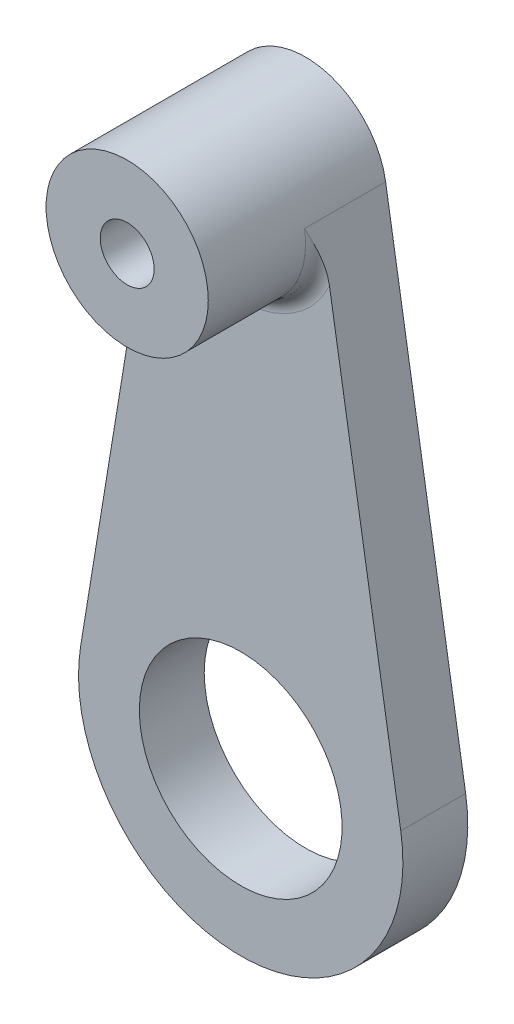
ISO-10303-21;
HEADER;
FILE_DESCRIPTION(('STEP AP214'),'2;1');
FILE_NAME('part.step','',(''),(''),'','','');
FILE_SCHEMA(('AUTOMOTIVE_DESIGN { 1 0 10303 214 1 1 1 1 }'));
ENDSEC;
DATA;
#1=APPLICATION_CONTEXT('core data for automotive mechanical design processes');
#2=APPLICATION_PROTOCOL_DEFINITION('international standard','automotive_design',2000,#1);
#3=PRODUCT_CONTEXT('',#1,'mechanical');
#4=PRODUCT('Part','Part','',(#3));
#5=PRODUCT_RELATED_PRODUCT_CATEGORY('part','',(#4));
#6=PRODUCT_DEFINITION_FORMATION('','',#4);
#7=PRODUCT_DEFINITION_CONTEXT('part definition',#1,'design');
#8=PRODUCT_DEFINITION('design','',#6,#7);
#9=PRODUCT_DEFINITION_SHAPE('','',#8);
#10=(LENGTH_UNIT() NAMED_UNIT(*) SI_UNIT(.MILLI.,.METRE.));
#11=(NAMED_UNIT(*) PLANE_ANGLE_UNIT() SI_UNIT($,.RADIAN.));
#12=(NAMED_UNIT(*) SI_UNIT($,.STERADIAN.) SOLID_ANGLE_UNIT());
#13=UNCERTAINTY_MEASURE_WITH_UNIT(LENGTH_MEASURE(1.E-05),#10,'distance_accuracy_value','');
#14=(GEOMETRIC_REPRESENTATION_CONTEXT(3) GLOBAL_UNCERTAINTY_ASSIGNED_CONTEXT((#13)) GLOBAL_UNIT_ASSIGNED_CONTEXT((#10,
#11,#12)) REPRESENTATION_CONTEXT('',''));
#15=CARTESIAN_POINT('',(0.,0.,0.));
#16=DIRECTION('',(0.,0.,1.));
#17=DIRECTION('',(1.,0.,0.));
#18=AXIS2_PLACEMENT_3D('',#15,#16,#17);
#19=CARTESIAN_POINT('',(0.,62.,4.0000000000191));
#20=DIRECTION('',(0.,0.,1.));
#21=DIRECTION('',(1.,0.,0.));
#22=AXIS2_PLACEMENT_3D('',#19,#20,#21);
#23=CONICAL_SURFACE('',#22,3.32349999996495,1.02974425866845);
#24=CARTESIAN_POINT('',(0.,62.,4.));
#25=DIRECTION('',(0.,0.,1.));
#26=DIRECTION('',(1.,0.,0.));
#27=AXIS2_PLACEMENT_3D('',#24,#25,#26);
#28=CIRCLE('',#27,3.3235);
#29=CARTESIAN_POINT('',(3.3235,62.,4.));
#30=VERTEX_POINT('',#29);
#31=EDGE_CURVE('E127',#30,#30,#28,.T.);
#32=ORIENTED_EDGE('',*,*,#31,.T.);
#33=EDGE_LOOP('',(#32));
#34=FACE_BOUND('',#33,.T.);
#35=CARTESIAN_POINT('',(0.,62.,2.00303973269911));
#36=VERTEX_POINT('',#35);
#37=VERTEX_LOOP('',#36);
#38=FACE_BOUND('',#37,.T.);
#39=ADVANCED_FACE('F16',(#34,#38),#23,.F.);
#40=CARTESIAN_POINT('',(0.,62.,13.));
#41=DIRECTION('',(0.,0.,1.));
#42=DIRECTION('',(1.,0.,0.));
#43=AXIS2_PLACEMENT_3D('',#40,#41,#42);
#44=CYLINDRICAL_SURFACE('',#43,3.3235);
#45=ORIENTED_EDGE('',*,*,#31,.F.);
#46=EDGE_LOOP('',(#45));
#47=FACE_BOUND('',#46,.T.);
#48=CARTESIAN_POINT('',(0.,62.,22.));
#49=DIRECTION('',(0.,0.,1.));
#50=DIRECTION('',(1.,0.,0.));
#51=AXIS2_PLACEMENT_3D('',#48,#49,#50);
#52=CIRCLE('',#51,3.3235);
#53=CARTESIAN_POINT('',(3.3235,62.,22.));
#54=VERTEX_POINT('',#53);
#55=EDGE_CURVE('E20',#54,#54,#52,.T.);
#56=ORIENTED_EDGE('',*,*,#55,.T.);
#57=EDGE_LOOP('',(#56));
#58=FACE_BOUND('',#57,.T.);
#59=ADVANCED_FACE('F78',(#47,#58),#44,.F.);
#60=CARTESIAN_POINT('',(0.,24.2368076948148,8.));
#61=DIRECTION('',(0.,0.,1.));
#62=DIRECTION('',(1.,0.,0.));
#63=AXIS2_PLACEMENT_3D('',#60,#61,#62);
#64=PLANE('',#63);
#65=CARTESIAN_POINT('',(0.,0.,8.));
#66=DIRECTION('',(0.,0.,-1.));
#67=DIRECTION('',(-1.,0.,0.));
#68=AXIS2_PLACEMENT_3D('',#65,#66,#67);
#69=CIRCLE('',#68,12.5);
#70=CARTESIAN_POINT('',(-12.5,0.,8.));
#71=VERTEX_POINT('',#70);
#72=EDGE_CURVE('E121',#71,#71,#69,.T.);
#73=ORIENTED_EDGE('',*,*,#72,.T.);
#74=EDGE_LOOP('',(#73));
#75=FACE_BOUND('',#74,.T.);
#76=CARTESIAN_POINT('',(0.,0.,8.));
#77=DIRECTION('',(0.,0.,1.));
#78=DIRECTION('',(1.,0.,0.));
#79=AXIS2_PLACEMENT_3D('',#76,#77,#78);
#80=CIRCLE('',#79,20.);
#81=CARTESIAN_POINT('',(19.7381400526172,3.2258064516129,8.));
#82=VERTEX_POINT('',#81);
#83=CARTESIAN_POINT('',(-19.7381400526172,3.2258064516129,8.));
#84=VERTEX_POINT('',#83);
#85=EDGE_CURVE('E118',#82,#84,#80,.F.);
#86=ORIENTED_EDGE('',*,*,#85,.F.);
#87=DIRECTION('',(-0.161290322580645,0.986907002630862,0.));
#88=VECTOR('',#87,1.);
#89=CARTESIAN_POINT('',(9.86907002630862,63.6129032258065,8.));
#90=LINE('',#89,#88);
#91=CARTESIAN_POINT('',(10.9389489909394,57.0665027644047,8.));
#92=VERTEX_POINT('',#91);
#93=EDGE_CURVE('E55',#92,#82,#90,.F.);
#94=ORIENTED_EDGE('',*,*,#93,.F.);
#95=CARTESIAN_POINT('',(0.,62.,8.));
#96=DIRECTION('',(0.,0.,1.));
#97=DIRECTION('',(-0.911579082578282,-0.411124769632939,0.));
#98=AXIS2_PLACEMENT_3D('',#95,#96,#97);
#99=CIRCLE('',#98,12.);
#100=CARTESIAN_POINT('',(-10.9389489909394,57.0665027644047,8.));
#101=VERTEX_POINT('',#100);
#102=EDGE_CURVE('E63',#101,#92,#99,.T.);
#103=ORIENTED_EDGE('',*,*,#102,.F.);
#104=DIRECTION('',(-0.161290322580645,-0.986907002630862,0.));
#105=VECTOR('',#104,1.);
#106=CARTESIAN_POINT('',(-19.7381400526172,3.2258064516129,8.));
#107=LINE('',#106,#105);
#108=EDGE_CURVE('E74',#84,#101,#107,.F.);
#109=ORIENTED_EDGE('',*,*,#108,.F.);
#110=EDGE_LOOP('',(#86,#94,#103,#109));
#111=FACE_BOUND('',#110,.T.);
#112=ADVANCED_FACE('F84',(#75,#111),#64,.T.);
#113=CARTESIAN_POINT('',(0.,62.,22.));
#114=DIRECTION('',(0.,0.,-1.));
#115=DIRECTION('',(-1.,0.,0.));
#116=AXIS2_PLACEMENT_3D('',#113,#114,#115);
#117=PLANE('',#116);
#118=CARTESIAN_POINT('',(0.,62.,22.));
#119=DIRECTION('',(0.,0.,1.));
#120=DIRECTION('',(1.,0.,0.));
#121=AXIS2_PLACEMENT_3D('',#118,#119,#120);
#122=CIRCLE('',#121,10.);
#123=CARTESIAN_POINT('',(10.,62.,22.));
#124=VERTEX_POINT('',#123);
#125=EDGE_CURVE('E114',#124,#124,#122,.F.);
#126=ORIENTED_EDGE('',*,*,#125,.F.);
#127=EDGE_LOOP('',(#126));
#128=FACE_BOUND('',#127,.T.);
#129=ORIENTED_EDGE('',*,*,#55,.F.);
#130=EDGE_LOOP('',(#129));
#131=FACE_BOUND('',#130,.T.);
#132=ADVANCED_FACE('F149',(#128,#131),#117,.F.);
#133=CARTESIAN_POINT('',(0.,62.,10.));
#134=DIRECTION('',(0.,0.,-1.));
#135=DIRECTION('',(-1.,0.,0.));
#136=AXIS2_PLACEMENT_3D('',#133,#134,#135);
#137=TOROIDAL_SURFACE('',#136,12.,2.);
#138=CARTESIAN_POINT('',(-9.86907002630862,63.6129032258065,10.));
#139=CARTESIAN_POINT('',(-9.90232435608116,63.4091803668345,9.90763835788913));
#140=CARTESIAN_POINT('',(-9.93565246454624,63.2055266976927,9.81512482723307));
#141=CARTESIAN_POINT('',(-9.997579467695,62.8273180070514,9.64483307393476));
#142=CARTESIAN_POINT('',(-10.0261605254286,62.6528427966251,9.56687031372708));
#143=CARTESIAN_POINT('',(-10.0807919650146,62.3190008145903,9.42002107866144));
#144=CARTESIAN_POINT('',(-10.1068347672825,62.1597114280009,9.35095655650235));
#145=CARTESIAN_POINT('',(-10.1627967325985,61.8177708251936,9.20528062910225));
#146=CARTESIAN_POINT('',(-10.1927447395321,61.6349922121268,9.12897806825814));
#147=CARTESIAN_POINT('',(-10.2544615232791,61.2583940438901,8.97645364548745));
#148=CARTESIAN_POINT('',(-10.2862444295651,61.0644919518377,8.90043963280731));
#149=CARTESIAN_POINT('',(-10.347849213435,60.6878373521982,8.75916267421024));
#150=CARTESIAN_POINT('',(-10.377657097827,60.5052257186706,8.69352008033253));
#151=CARTESIAN_POINT('',(-10.4352391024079,60.1515370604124,8.57300564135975));
#152=CARTESIAN_POINT('',(-10.4630002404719,59.9806081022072,8.51769610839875));
#153=CARTESIAN_POINT('',(-10.5054622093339,59.7197154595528,8.43837259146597));
#154=CARTESIAN_POINT('',(-10.5200134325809,59.6304074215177,8.41211600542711));
#155=CARTESIAN_POINT('',(-10.5491945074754,59.4517346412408,8.36153044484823));
#156=CARTESIAN_POINT('',(-10.5638236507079,59.3623722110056,8.33719285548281));
#157=CARTESIAN_POINT('',(-10.6103069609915,59.078523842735,8.26327411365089));
#158=CARTESIAN_POINT('',(-10.6423375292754,58.8830722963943,8.21738242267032));
#159=CARTESIAN_POINT('',(-10.6900618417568,58.5916331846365,8.15779437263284));
#160=CARTESIAN_POINT('',(-10.7056335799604,58.4965059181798,8.13972548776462));
#161=CARTESIAN_POINT('',(-10.7364501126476,58.3080975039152,8.10690256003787));
#162=CARTESIAN_POINT('',(-10.7516935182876,58.214828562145,8.09207786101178));
#163=CARTESIAN_POINT('',(-10.7818302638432,58.0302701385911,8.06578363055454));
#164=CARTESIAN_POINT('',(-10.7967225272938,57.9389914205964,8.0542376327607));
#165=CARTESIAN_POINT('',(-10.8261398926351,57.7585586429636,8.03452476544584));
#166=CARTESIAN_POINT('',(-10.8406640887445,57.66941352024,8.02627531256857));
#167=CARTESIAN_POINT('',(-10.8693345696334,57.4934056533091,8.01316008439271));
#168=CARTESIAN_POINT('',(-10.8834799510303,57.4065495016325,8.00820538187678));
#169=CARTESIAN_POINT('',(-10.9113925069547,57.2352961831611,8.00167584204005));
#170=CARTESIAN_POINT('',(-10.9251584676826,57.150902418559,8.00000520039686));
#171=CARTESIAN_POINT('',(-10.9389489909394,57.0665027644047,8.));
#172=B_SPLINE_CURVE_WITH_KNOTS('',3,(#138,#139,#140,#141,#142,#143,#144,#145,#146,#147,#148,
#149,#150,#151,#152,#153,#154,#155,#156,#157,#158,#159,#160,#161,#162,#163,#164,#165,#166,#167,
#168,#169,#170,#171),.UNSPECIFIED.,.F.,.F.,(4,2,2,2,2,2,2,2,2,2,2,2,2,2,2,2,4),(0.,
0.678439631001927,1.25811537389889,1.78478330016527,2.38570624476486,3.01767644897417,
3.60657147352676,4.15182576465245,4.43446274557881,4.71574859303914,5.32532714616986,
5.61950949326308,5.9064494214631,6.186011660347,6.4580496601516,6.72240986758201,
6.97893632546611),.UNSPECIFIED.);
#173=CARTESIAN_POINT('',(-9.86907002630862,63.6129032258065,10.));
#174=VERTEX_POINT('',#173);
#175=EDGE_CURVE('E120',#101,#174,#172,.F.);
#176=ORIENTED_EDGE('',*,*,#175,.F.);
#177=ORIENTED_EDGE('',*,*,#102,.T.);
#178=CARTESIAN_POINT('',(10.9389489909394,57.0665027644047,8.));
#179=CARTESIAN_POINT('',(10.9174950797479,57.1978379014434,8.00002471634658));
#180=CARTESIAN_POINT('',(10.8960650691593,57.3291246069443,8.00405662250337));
#181=CARTESIAN_POINT('',(10.852352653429,57.5969348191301,8.01961711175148));
#182=CARTESIAN_POINT('',(10.8300731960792,57.7334409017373,8.03146042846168));
#183=CARTESIAN_POINT('',(10.7847205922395,58.0111220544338,8.06259726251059));
#184=CARTESIAN_POINT('',(10.761651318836,58.1522656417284,8.08216966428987));
#185=CARTESIAN_POINT('',(10.7148075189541,58.4387677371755,8.12866019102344));
#186=CARTESIAN_POINT('',(10.6910388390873,58.5840867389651,8.15582540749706));
#187=CARTESIAN_POINT('',(10.645475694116,58.862880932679,8.21400605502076));
#188=CARTESIAN_POINT('',(10.6236641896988,58.9964437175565,8.24459349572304));
#189=CARTESIAN_POINT('',(10.5792776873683,59.2681760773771,8.3117740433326));
#190=CARTESIAN_POINT('',(10.556710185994,59.4062968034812,8.34856882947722));
#191=CARTESIAN_POINT('',(10.5108471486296,59.6868907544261,8.42809716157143));
#192=CARTESIAN_POINT('',(10.4875591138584,59.829313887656,8.47101079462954));
#193=CARTESIAN_POINT('',(10.4403027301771,60.1183494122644,8.56262918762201));
#194=CARTESIAN_POINT('',(10.4163426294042,60.2649124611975,8.61149312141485));
#195=CARTESIAN_POINT('',(10.3720438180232,60.5363605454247,8.70574770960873));
#196=CARTESIAN_POINT('',(10.3516682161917,60.6614048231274,8.75066528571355));
#197=CARTESIAN_POINT('',(10.3095514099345,60.9197555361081,8.84623490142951));
#198=CARTESIAN_POINT('',(10.2878193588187,61.0529971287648,8.8970660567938));
#199=CARTESIAN_POINT('',(10.24298597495,61.3275492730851,9.00457801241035));
#200=CARTESIAN_POINT('',(10.2198913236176,61.4687968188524,9.06142200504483));
#201=CARTESIAN_POINT('',(10.1723648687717,61.7593106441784,9.18092425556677));
#202=CARTESIAN_POINT('',(10.147940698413,61.9085201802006,9.2437230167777));
#203=CARTESIAN_POINT('',(10.1063599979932,62.1626751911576,9.35245571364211));
#204=CARTESIAN_POINT('',(10.0891670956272,62.2678034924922,9.3979504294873));
#205=CARTESIAN_POINT('',(10.0520831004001,62.4944283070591,9.49700847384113));
#206=CARTESIAN_POINT('',(10.0321979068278,62.6158680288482,9.55070396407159));
#207=CARTESIAN_POINT('',(9.98976199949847,62.8750393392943,9.66625696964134));
#208=CARTESIAN_POINT('',(9.96721944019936,63.0127229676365,9.72822462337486));
#209=CARTESIAN_POINT('',(9.9194621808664,63.3045715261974,9.86012671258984));
#210=CARTESIAN_POINT('',(9.8942545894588,63.4587124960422,9.93011686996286));
#211=CARTESIAN_POINT('',(9.86907002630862,63.6129032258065,10.));
#212=B_SPLINE_CURVE_WITH_KNOTS('',3,(#178,#179,#180,#181,#182,#183,#184,#185,#186,#187,#188,
#189,#190,#191,#192,#193,#194,#195,#196,#197,#198,#199,#200,#201,#202,#203,#204,#205,#206,#207,
#208,#209,#210,#211),.UNSPECIFIED.,.F.,.F.,(4,2,2,2,2,2,2,2,2,2,2,2,2,2,2,2,4),(0.,
0.399093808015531,0.815339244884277,1.24822334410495,1.69727807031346,2.11342775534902,
2.54747086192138,2.999080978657,3.46804619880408,3.87128264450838,4.30402054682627,
4.76599348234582,5.2571325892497,5.60462945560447,6.00741065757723,6.46538815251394,
6.97884536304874),.UNSPECIFIED.);
#213=CARTESIAN_POINT('',(9.86907002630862,63.6129032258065,10.));
#214=VERTEX_POINT('',#213);
#215=EDGE_CURVE('E117',#214,#92,#212,.F.);
#216=ORIENTED_EDGE('',*,*,#215,.F.);
#217=CARTESIAN_POINT('',(0.,62.,10.));
#218=DIRECTION('',(0.,0.,1.));
#219=DIRECTION('',(1.,0.,0.));
#220=AXIS2_PLACEMENT_3D('',#217,#218,#219);
#221=CIRCLE('',#220,10.);
#222=EDGE_CURVE('E105',#174,#214,#221,.T.);
#223=ORIENTED_EDGE('',*,*,#222,.F.);
#224=EDGE_LOOP('',(#176,#177,#216,#223));
#225=FACE_BOUND('',#224,.T.);
#226=ADVANCED_FACE('F137',(#225),#137,.F.);
#227=CARTESIAN_POINT('',(0.,0.,8.));
#228=DIRECTION('',(0.,0.,-1.));
#229=DIRECTION('',(-1.,0.,0.));
#230=AXIS2_PLACEMENT_3D('',#227,#228,#229);
#231=CYLINDRICAL_SURFACE('',#230,12.5);
#232=CARTESIAN_POINT('',(0.,0.,0.));
#233=DIRECTION('',(0.,0.,-1.));
#234=DIRECTION('',(-1.,0.,0.));
#235=AXIS2_PLACEMENT_3D('',#232,#233,#234);
#236=CIRCLE('',#235,12.5);
#237=CARTESIAN_POINT('',(-12.5,0.,0.));
#238=VERTEX_POINT('',#237);
#239=EDGE_CURVE('E102',#238,#238,#236,.T.);
#240=ORIENTED_EDGE('',*,*,#239,.T.);
#241=EDGE_LOOP('',(#240));
#242=FACE_BOUND('',#241,.T.);
#243=ORIENTED_EDGE('',*,*,#72,.F.);
#244=EDGE_LOOP('',(#243));
#245=FACE_BOUND('',#244,.T.);
#246=ADVANCED_FACE('F148',(#242,#245),#231,.F.);
#247=CARTESIAN_POINT('',(-19.7381400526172,3.2258064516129,0.));
#248=DIRECTION('',(-0.986907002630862,0.161290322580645,0.));
#249=DIRECTION('',(-0.161290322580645,-0.986907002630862,0.));
#250=AXIS2_PLACEMENT_3D('',#247,#248,#249);
#251=PLANE('',#250);
#252=DIRECTION('',(-0.161290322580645,-0.986907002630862,0.));
#253=VECTOR('',#252,1.);
#254=CARTESIAN_POINT('',(-9.86907002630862,63.6129032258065,0.));
#255=LINE('',#254,#253);
#256=CARTESIAN_POINT('',(-9.86907002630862,63.6129032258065,0.));
#257=VERTEX_POINT('',#256);
#258=CARTESIAN_POINT('',(-19.7381400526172,3.2258064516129,0.));
#259=VERTEX_POINT('',#258);
#260=EDGE_CURVE('E104',#257,#259,#255,.T.);
#261=ORIENTED_EDGE('',*,*,#260,.T.);
#262=DIRECTION('',(0.,0.,1.));
#263=VECTOR('',#262,1.);
#264=CARTESIAN_POINT('',(-19.7381400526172,3.2258064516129,0.));
#265=LINE('',#264,#263);
#266=EDGE_CURVE('E119',#84,#259,#265,.F.);
#267=ORIENTED_EDGE('',*,*,#266,.F.);
#268=ORIENTED_EDGE('',*,*,#108,.T.);
#269=ORIENTED_EDGE('',*,*,#175,.T.);
#270=DIRECTION('',(0.,0.,1.));
#271=VECTOR('',#270,1.);
#272=CARTESIAN_POINT('',(-9.86907002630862,63.6129032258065,0.));
#273=LINE('',#272,#271);
#274=EDGE_CURVE('E110',#257,#174,#273,.T.);
#275=ORIENTED_EDGE('',*,*,#274,.F.);
#276=EDGE_LOOP('',(#261,#267,#268,#269,#275));
#277=FACE_BOUND('',#276,.T.);
#278=ADVANCED_FACE('F176',(#277),#251,.T.);
#279=CARTESIAN_POINT('',(0.,0.,0.));
#280=DIRECTION('',(0.,0.,1.));
#281=DIRECTION('',(1.,0.,0.));
#282=AXIS2_PLACEMENT_3D('',#279,#280,#281);
#283=CYLINDRICAL_SURFACE('',#282,20.);
#284=CARTESIAN_POINT('',(0.,0.,0.));
#285=DIRECTION('',(0.,0.,1.));
#286=DIRECTION('',(1.,0.,0.));
#287=AXIS2_PLACEMENT_3D('',#284,#285,#286);
#288=CIRCLE('',#287,20.);
#289=CARTESIAN_POINT('',(19.7381400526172,3.2258064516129,0.));
#290=VERTEX_POINT('',#289);
#291=EDGE_CURVE('E108',#259,#290,#288,.T.);
#292=ORIENTED_EDGE('',*,*,#291,.T.);
#293=DIRECTION('',(0.,0.,1.));
#294=VECTOR('',#293,1.);
#295=CARTESIAN_POINT('',(19.7381400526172,3.2258064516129,0.));
#296=LINE('',#295,#294);
#297=EDGE_CURVE('E202',#82,#290,#296,.F.);
#298=ORIENTED_EDGE('',*,*,#297,.F.);
#299=ORIENTED_EDGE('',*,*,#85,.T.);
#300=ORIENTED_EDGE('',*,*,#266,.T.);
#301=EDGE_LOOP('',(#292,#298,#299,#300));
#302=FACE_BOUND('',#301,.T.);
#303=ADVANCED_FACE('F185',(#302),#283,.T.);
#304=CARTESIAN_POINT('',(9.86907002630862,63.6129032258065,0.));
#305=DIRECTION('',(0.986907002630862,0.161290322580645,0.));
#306=DIRECTION('',(-0.161290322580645,0.986907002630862,0.));
#307=AXIS2_PLACEMENT_3D('',#304,#305,#306);
#308=PLANE('',#307);
#309=DIRECTION('',(0.,0.,1.));
#310=VECTOR('',#309,1.);
#311=CARTESIAN_POINT('',(9.86907002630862,63.6129032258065,0.));
#312=LINE('',#311,#310);
#313=CARTESIAN_POINT('',(9.86907002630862,63.6129032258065,0.));
#314=VERTEX_POINT('',#313);
#315=EDGE_CURVE('E34',#214,#314,#312,.F.);
#316=ORIENTED_EDGE('',*,*,#315,.F.);
#317=ORIENTED_EDGE('',*,*,#215,.T.);
#318=ORIENTED_EDGE('',*,*,#93,.T.);
#319=ORIENTED_EDGE('',*,*,#297,.T.);
#320=DIRECTION('',(-0.161290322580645,0.986907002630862,0.));
#321=VECTOR('',#320,1.);
#322=CARTESIAN_POINT('',(19.7381400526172,3.2258064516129,0.));
#323=LINE('',#322,#321);
#324=EDGE_CURVE('E26',#290,#314,#323,.T.);
#325=ORIENTED_EDGE('',*,*,#324,.T.);
#326=EDGE_LOOP('',(#316,#317,#318,#319,#325));
#327=FACE_BOUND('',#326,.T.);
#328=ADVANCED_FACE('F93',(#327),#308,.T.);
#329=CARTESIAN_POINT('',(0.,62.,0.));
#330=DIRECTION('',(0.,0.,1.));
#331=DIRECTION('',(1.,0.,0.));
#332=AXIS2_PLACEMENT_3D('',#329,#330,#331);
#333=CYLINDRICAL_SURFACE('',#332,10.);
#334=ORIENTED_EDGE('',*,*,#125,.T.);
#335=EDGE_LOOP('',(#334));
#336=FACE_BOUND('',#335,.T.);
#337=ORIENTED_EDGE('',*,*,#274,.T.);
#338=ORIENTED_EDGE('',*,*,#222,.T.);
#339=ORIENTED_EDGE('',*,*,#315,.T.);
#340=CARTESIAN_POINT('',(0.,62.,0.));
#341=DIRECTION('',(0.,0.,1.));
#342=DIRECTION('',(1.,0.,0.));
#343=AXIS2_PLACEMENT_3D('',#340,#341,#342);
#344=CIRCLE('',#343,10.);
#345=EDGE_CURVE('E10',#314,#257,#344,.T.);
#346=ORIENTED_EDGE('',*,*,#345,.T.);
#347=EDGE_LOOP('',(#337,#338,#339,#346));
#348=FACE_BOUND('',#347,.T.);
#349=ADVANCED_FACE('F89',(#336,#348),#333,.T.);
#350=CARTESIAN_POINT('',(0.,24.2368076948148,0.));
#351=DIRECTION('',(0.,0.,1.));
#352=DIRECTION('',(1.,0.,0.));
#353=AXIS2_PLACEMENT_3D('',#350,#351,#352);
#354=PLANE('',#353);
#355=ORIENTED_EDGE('',*,*,#324,.F.);
#356=ORIENTED_EDGE('',*,*,#291,.F.);
#357=ORIENTED_EDGE('',*,*,#260,.F.);
#358=ORIENTED_EDGE('',*,*,#345,.F.);
#359=EDGE_LOOP('',(#355,#356,#357,#358));
#360=FACE_BOUND('',#359,.T.);
#361=ORIENTED_EDGE('',*,*,#239,.F.);
#362=EDGE_LOOP('',(#361));
#363=FACE_BOUND('',#362,.T.);
#364=ADVANCED_FACE('F18',(#360,#363),#354,.F.);
#365=CLOSED_SHELL('',(#39,#59,#112,#132,#226,#246,#278,#303,#328,#349,#364));
#366=MANIFOLD_SOLID_BREP('B1',#365);
#367=ADVANCED_BREP_SHAPE_REPRESENTATION('',(#18,#366),#14);
#368=SHAPE_DEFINITION_REPRESENTATION(#9,#367);
ENDSEC;
END-ISO-10303-21;
